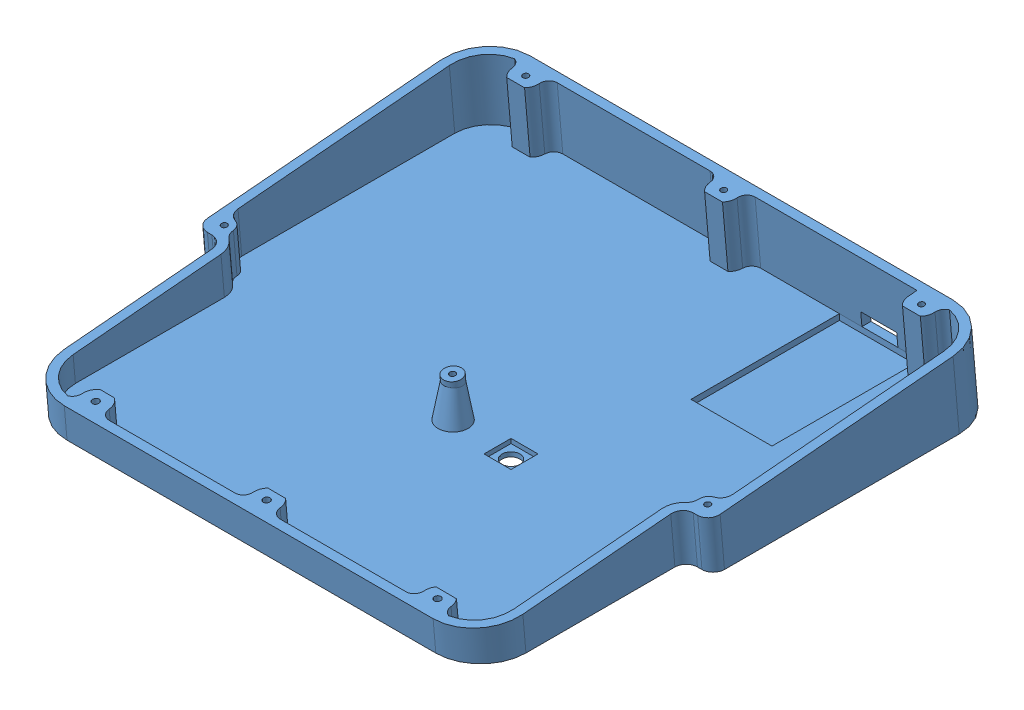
SolidWorks assembly full_assembly.SLDASM, configuration Default (file format 14000). Lengths in mm.
Overall size (114 17.83 111.14).
2 component instances, 2 part files, 3 mates.
Components (placement in the parent):
- Base-1: Base.SLDPRT [Default] at (-6.1109 38.5768 127.3932) size (114 16.53 111.03)
- Top Plate-2: Top Plate.SLDPRT [Default] at (81.8891 47.2544 123.1333) x (-1 0 0) z (0 -0.087156 0.996195) size (114 1.3 110)
Mates (geometry in assembly coordinates):
- Coincident4: coincident anti-aligned: plane of Base-1 through (75.8891 46.3952 118.039) normal (0 0.996195 0.087156); plane of Top Plate-2 through (75.8891 46.3952 118.039) normal (0 -0.996195 -0.087156)
- Coincident5: coincident aligned: plane of Base-1 through (75.8891 -124.3325 113.1405) normal (0 -0.087156 0.996195); plane of Top Plate-2 through (75.8891 45.5236 128.001) normal (0 -0.087156 0.996195)
- Coincident6: coincident aligned: plane of Base-1 through (-22.1109 -115.617 13.521) normal (-1 0 0); plane of Top Plate-2 through (-22.1109 54.2392 28.3815) normal (-1 0 0)
